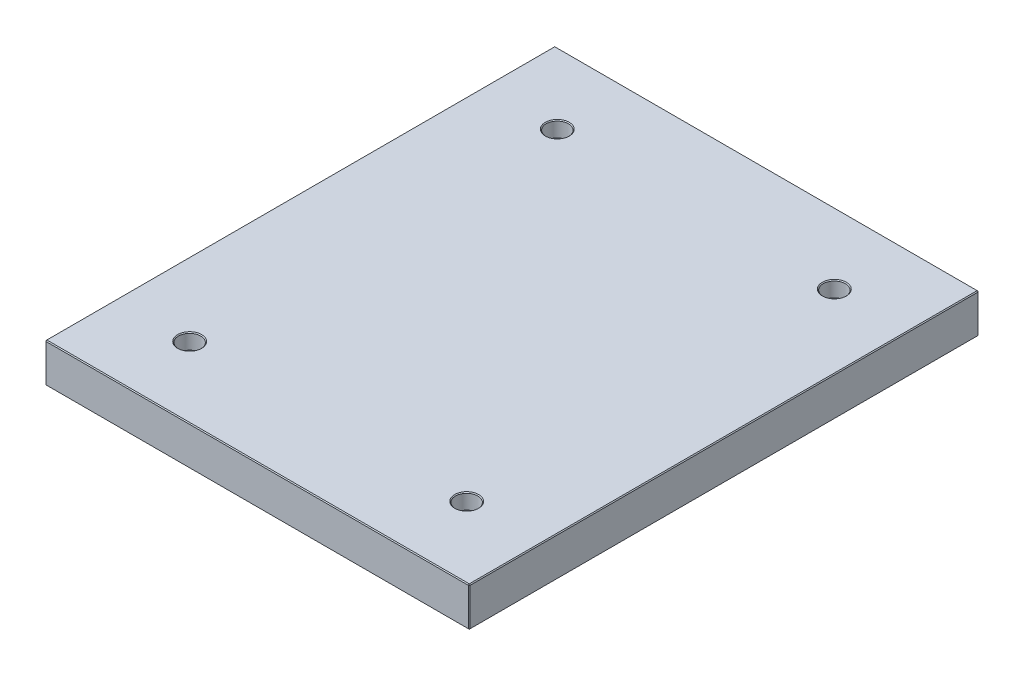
ISO-10303-21;
HEADER;
FILE_DESCRIPTION(('STEP AP214'),'2;1');
FILE_NAME('part.step','',(''),(''),'','','');
FILE_SCHEMA(('AUTOMOTIVE_DESIGN { 1 0 10303 214 1 1 1 1 }'));
ENDSEC;
DATA;
#1=APPLICATION_CONTEXT('core data for automotive mechanical design processes');
#2=APPLICATION_PROTOCOL_DEFINITION('international standard','automotive_design',2000,#1);
#3=PRODUCT_CONTEXT('',#1,'mechanical');
#4=PRODUCT('Part','Part','',(#3));
#5=PRODUCT_RELATED_PRODUCT_CATEGORY('part','',(#4));
#6=PRODUCT_DEFINITION_FORMATION('','',#4);
#7=PRODUCT_DEFINITION_CONTEXT('part definition',#1,'design');
#8=PRODUCT_DEFINITION('design','',#6,#7);
#9=PRODUCT_DEFINITION_SHAPE('','',#8);
#10=(LENGTH_UNIT() NAMED_UNIT(*) SI_UNIT(.MILLI.,.METRE.));
#11=(NAMED_UNIT(*) PLANE_ANGLE_UNIT() SI_UNIT($,.RADIAN.));
#12=(NAMED_UNIT(*) SI_UNIT($,.STERADIAN.) SOLID_ANGLE_UNIT());
#13=UNCERTAINTY_MEASURE_WITH_UNIT(LENGTH_MEASURE(1.E-05),#10,'distance_accuracy_value','');
#14=(GEOMETRIC_REPRESENTATION_CONTEXT(3) GLOBAL_UNCERTAINTY_ASSIGNED_CONTEXT((#13)) GLOBAL_UNIT_ASSIGNED_CONTEXT((#10,
#11,#12)) REPRESENTATION_CONTEXT('',''));
#15=CARTESIAN_POINT('',(0.,0.,0.));
#16=DIRECTION('',(0.,0.,1.));
#17=DIRECTION('',(1.,0.,0.));
#18=AXIS2_PLACEMENT_3D('',#15,#16,#17);
#19=CARTESIAN_POINT('',(-248.,46.,298.));
#20=DIRECTION('',(1.,0.,0.));
#21=DIRECTION('',(0.,0.,-1.));
#22=AXIS2_PLACEMENT_3D('',#19,#20,#21);
#23=PLANE('',#22);
#24=DIRECTION('',(0.,-1.,0.));
#25=VECTOR('',#24,1.);
#26=CARTESIAN_POINT('',(-248.,46.,-297.));
#27=LINE('',#26,#25);
#28=CARTESIAN_POINT('',(-248.,45.,-297.));
#29=VERTEX_POINT('',#28);
#30=CARTESIAN_POINT('',(-248.,1.,-297.));
#31=VERTEX_POINT('',#30);
#32=EDGE_CURVE('E115',#29,#31,#27,.T.);
#33=ORIENTED_EDGE('',*,*,#32,.T.);
#34=DIRECTION('',(0.,0.,1.));
#35=VECTOR('',#34,1.);
#36=CARTESIAN_POINT('',(-248.,1.,298.));
#37=LINE('',#36,#35);
#38=CARTESIAN_POINT('',(-248.,1.,297.));
#39=VERTEX_POINT('',#38);
#40=EDGE_CURVE('E111',#31,#39,#37,.T.);
#41=ORIENTED_EDGE('',*,*,#40,.T.);
#42=DIRECTION('',(0.,1.,0.));
#43=VECTOR('',#42,1.);
#44=CARTESIAN_POINT('',(-248.,46.,297.));
#45=LINE('',#44,#43);
#46=CARTESIAN_POINT('',(-248.,45.,297.));
#47=VERTEX_POINT('',#46);
#48=EDGE_CURVE('E104',#39,#47,#45,.T.);
#49=ORIENTED_EDGE('',*,*,#48,.T.);
#50=DIRECTION('',(0.,0.,-1.));
#51=VECTOR('',#50,1.);
#52=CARTESIAN_POINT('',(-248.,45.,-298.));
#53=LINE('',#52,#51);
#54=EDGE_CURVE('E108',#47,#29,#53,.T.);
#55=ORIENTED_EDGE('',*,*,#54,.T.);
#56=EDGE_LOOP('',(#33,#41,#49,#55));
#57=FACE_BOUND('',#56,.T.);
#58=ADVANCED_FACE('F16',(#57),#23,.F.);
#59=CARTESIAN_POINT('',(248.,46.,298.));
#60=DIRECTION('',(0.,0.,-1.));
#61=DIRECTION('',(-1.,0.,0.));
#62=AXIS2_PLACEMENT_3D('',#59,#60,#61);
#63=PLANE('',#62);
#64=DIRECTION('',(-1.,0.,0.));
#65=VECTOR('',#64,1.);
#66=CARTESIAN_POINT('',(-248.,45.,298.));
#67=LINE('',#66,#65);
#68=CARTESIAN_POINT('',(247.,45.,298.));
#69=VERTEX_POINT('',#68);
#70=CARTESIAN_POINT('',(-247.,45.,298.));
#71=VERTEX_POINT('',#70);
#72=EDGE_CURVE('E170',#69,#71,#67,.T.);
#73=ORIENTED_EDGE('',*,*,#72,.T.);
#74=DIRECTION('',(0.,-1.,0.));
#75=VECTOR('',#74,1.);
#76=CARTESIAN_POINT('',(-247.,46.,298.));
#77=LINE('',#76,#75);
#78=CARTESIAN_POINT('',(-247.,1.,298.));
#79=VERTEX_POINT('',#78);
#80=EDGE_CURVE('E123',#71,#79,#77,.T.);
#81=ORIENTED_EDGE('',*,*,#80,.T.);
#82=DIRECTION('',(1.,0.,0.));
#83=VECTOR('',#82,1.);
#84=CARTESIAN_POINT('',(248.,1.,298.));
#85=LINE('',#84,#83);
#86=CARTESIAN_POINT('',(247.,1.,298.));
#87=VERTEX_POINT('',#86);
#88=EDGE_CURVE('E174',#79,#87,#85,.T.);
#89=ORIENTED_EDGE('',*,*,#88,.T.);
#90=DIRECTION('',(0.,1.,0.));
#91=VECTOR('',#90,1.);
#92=CARTESIAN_POINT('',(247.,46.,298.));
#93=LINE('',#92,#91);
#94=EDGE_CURVE('E172',#87,#69,#93,.T.);
#95=ORIENTED_EDGE('',*,*,#94,.T.);
#96=EDGE_LOOP('',(#73,#81,#89,#95));
#97=FACE_BOUND('',#96,.T.);
#98=ADVANCED_FACE('F317',(#97),#63,.F.);
#99=CARTESIAN_POINT('',(248.,46.,298.));
#100=DIRECTION('',(-1.,0.,0.));
#101=DIRECTION('',(0.,0.,1.));
#102=AXIS2_PLACEMENT_3D('',#99,#100,#101);
#103=PLANE('',#102);
#104=DIRECTION('',(0.,0.,-1.));
#105=VECTOR('',#104,1.);
#106=CARTESIAN_POINT('',(248.,1.,298.));
#107=LINE('',#106,#105);
#108=CARTESIAN_POINT('',(248.,1.,297.));
#109=VERTEX_POINT('',#108);
#110=CARTESIAN_POINT('',(248.,1.,-297.));
#111=VERTEX_POINT('',#110);
#112=EDGE_CURVE('E165',#109,#111,#107,.T.);
#113=ORIENTED_EDGE('',*,*,#112,.T.);
#114=DIRECTION('',(0.,1.,0.));
#115=VECTOR('',#114,1.);
#116=CARTESIAN_POINT('',(248.,46.,-297.));
#117=LINE('',#116,#115);
#118=CARTESIAN_POINT('',(248.,45.,-297.));
#119=VERTEX_POINT('',#118);
#120=EDGE_CURVE('E167',#111,#119,#117,.T.);
#121=ORIENTED_EDGE('',*,*,#120,.T.);
#122=DIRECTION('',(0.,0.,1.));
#123=VECTOR('',#122,1.);
#124=CARTESIAN_POINT('',(248.,45.,298.));
#125=LINE('',#124,#123);
#126=CARTESIAN_POINT('',(248.,45.,297.));
#127=VERTEX_POINT('',#126);
#128=EDGE_CURVE('E161',#119,#127,#125,.T.);
#129=ORIENTED_EDGE('',*,*,#128,.T.);
#130=DIRECTION('',(0.,-1.,0.));
#131=VECTOR('',#130,1.);
#132=CARTESIAN_POINT('',(248.,46.,297.));
#133=LINE('',#132,#131);
#134=EDGE_CURVE('E163',#127,#109,#133,.T.);
#135=ORIENTED_EDGE('',*,*,#134,.T.);
#136=EDGE_LOOP('',(#113,#121,#129,#135));
#137=FACE_BOUND('',#136,.T.);
#138=ADVANCED_FACE('F323',(#137),#103,.F.);
#139=CARTESIAN_POINT('',(248.,46.,-298.));
#140=DIRECTION('',(0.,0.,1.));
#141=DIRECTION('',(1.,0.,0.));
#142=AXIS2_PLACEMENT_3D('',#139,#140,#141);
#143=PLANE('',#142);
#144=DIRECTION('',(0.,-1.,0.));
#145=VECTOR('',#144,1.);
#146=CARTESIAN_POINT('',(247.,46.,-298.));
#147=LINE('',#146,#145);
#148=CARTESIAN_POINT('',(247.,45.,-298.));
#149=VERTEX_POINT('',#148);
#150=CARTESIAN_POINT('',(247.,1.,-298.));
#151=VERTEX_POINT('',#150);
#152=EDGE_CURVE('E154',#149,#151,#147,.T.);
#153=ORIENTED_EDGE('',*,*,#152,.T.);
#154=DIRECTION('',(-1.,0.,0.));
#155=VECTOR('',#154,1.);
#156=CARTESIAN_POINT('',(248.,1.,-298.));
#157=LINE('',#156,#155);
#158=CARTESIAN_POINT('',(-247.,1.,-298.));
#159=VERTEX_POINT('',#158);
#160=EDGE_CURVE('E159',#151,#159,#157,.T.);
#161=ORIENTED_EDGE('',*,*,#160,.T.);
#162=DIRECTION('',(0.,1.,0.));
#163=VECTOR('',#162,1.);
#164=CARTESIAN_POINT('',(-247.,46.,-298.));
#165=LINE('',#164,#163);
#166=CARTESIAN_POINT('',(-247.,45.,-298.));
#167=VERTEX_POINT('',#166);
#168=EDGE_CURVE('E156',#159,#167,#165,.T.);
#169=ORIENTED_EDGE('',*,*,#168,.T.);
#170=DIRECTION('',(1.,0.,0.));
#171=VECTOR('',#170,1.);
#172=CARTESIAN_POINT('',(248.,45.,-298.));
#173=LINE('',#172,#171);
#174=EDGE_CURVE('E152',#167,#149,#173,.T.);
#175=ORIENTED_EDGE('',*,*,#174,.T.);
#176=EDGE_LOOP('',(#153,#161,#169,#175));
#177=FACE_BOUND('',#176,.T.);
#178=ADVANCED_FACE('F465',(#177),#143,.F.);
#179=CARTESIAN_POINT('',(0.,46.,0.));
#180=DIRECTION('',(0.,1.,0.));
#181=DIRECTION('',(0.,0.,1.));
#182=AXIS2_PLACEMENT_3D('',#179,#180,#181);
#183=PLANE('',#182);
#184=CARTESIAN_POINT('',(-162.,46.,215.));
#185=DIRECTION('',(0.,1.,0.));
#186=DIRECTION('',(0.,0.,1.));
#187=AXIS2_PLACEMENT_3D('',#184,#185,#186);
#188=CIRCLE('',#187,14.0000000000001);
#189=CARTESIAN_POINT('',(-162.,46.,229.));
#190=VERTEX_POINT('',#189);
#191=EDGE_CURVE('E290',#190,#190,#188,.F.);
#192=ORIENTED_EDGE('',*,*,#191,.T.);
#193=EDGE_LOOP('',(#192));
#194=FACE_BOUND('',#193,.T.);
#195=CARTESIAN_POINT('',(162.,46.,215.));
#196=DIRECTION('',(0.,1.,0.));
#197=DIRECTION('',(0.,0.,1.));
#198=AXIS2_PLACEMENT_3D('',#195,#196,#197);
#199=CIRCLE('',#198,14.0000000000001);
#200=CARTESIAN_POINT('',(162.,46.,229.));
#201=VERTEX_POINT('',#200);
#202=EDGE_CURVE('E287',#201,#201,#199,.F.);
#203=ORIENTED_EDGE('',*,*,#202,.T.);
#204=EDGE_LOOP('',(#203));
#205=FACE_BOUND('',#204,.T.);
#206=CARTESIAN_POINT('',(162.,46.,-215.));
#207=DIRECTION('',(0.,1.,0.));
#208=DIRECTION('',(0.,0.,1.));
#209=AXIS2_PLACEMENT_3D('',#206,#207,#208);
#210=CIRCLE('',#209,14.0000000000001);
#211=CARTESIAN_POINT('',(162.,46.,-201.));
#212=VERTEX_POINT('',#211);
#213=EDGE_CURVE('E284',#212,#212,#210,.F.);
#214=ORIENTED_EDGE('',*,*,#213,.T.);
#215=EDGE_LOOP('',(#214));
#216=FACE_BOUND('',#215,.T.);
#217=CARTESIAN_POINT('',(-162.,46.,-215.));
#218=DIRECTION('',(0.,1.,0.));
#219=DIRECTION('',(0.,0.,1.));
#220=AXIS2_PLACEMENT_3D('',#217,#218,#219);
#221=CIRCLE('',#220,14.0000000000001);
#222=CARTESIAN_POINT('',(-162.,46.,-201.));
#223=VERTEX_POINT('',#222);
#224=EDGE_CURVE('E281',#223,#223,#221,.F.);
#225=ORIENTED_EDGE('',*,*,#224,.T.);
#226=EDGE_LOOP('',(#225));
#227=FACE_BOUND('',#226,.T.);
#228=DIRECTION('',(0.,0.,-1.));
#229=VECTOR('',#228,1.);
#230=CARTESIAN_POINT('',(247.,46.,-298.));
#231=LINE('',#230,#229);
#232=CARTESIAN_POINT('',(247.,46.,297.));
#233=VERTEX_POINT('',#232);
#234=CARTESIAN_POINT('',(247.,46.,-297.));
#235=VERTEX_POINT('',#234);
#236=EDGE_CURVE('E31',#233,#235,#231,.T.);
#237=ORIENTED_EDGE('',*,*,#236,.T.);
#238=DIRECTION('',(-1.,0.,0.));
#239=VECTOR('',#238,1.);
#240=CARTESIAN_POINT('',(-248.,46.,-297.));
#241=LINE('',#240,#239);
#242=CARTESIAN_POINT('',(-247.,46.,-297.));
#243=VERTEX_POINT('',#242);
#244=EDGE_CURVE('E190',#235,#243,#241,.T.);
#245=ORIENTED_EDGE('',*,*,#244,.T.);
#246=DIRECTION('',(0.,0.,1.));
#247=VECTOR('',#246,1.);
#248=CARTESIAN_POINT('',(-247.,46.,298.));
#249=LINE('',#248,#247);
#250=CARTESIAN_POINT('',(-247.,46.,297.));
#251=VERTEX_POINT('',#250);
#252=EDGE_CURVE('E186',#243,#251,#249,.T.);
#253=ORIENTED_EDGE('',*,*,#252,.T.);
#254=DIRECTION('',(1.,0.,0.));
#255=VECTOR('',#254,1.);
#256=CARTESIAN_POINT('',(248.,46.,297.));
#257=LINE('',#256,#255);
#258=EDGE_CURVE('E36',#251,#233,#257,.T.);
#259=ORIENTED_EDGE('',*,*,#258,.T.);
#260=EDGE_LOOP('',(#237,#245,#253,#259));
#261=FACE_BOUND('',#260,.T.);
#262=ADVANCED_FACE('F462',(#194,#205,#216,#227,#261),#183,.T.);
#263=CARTESIAN_POINT('',(0.,0.,0.));
#264=DIRECTION('',(0.,1.,0.));
#265=DIRECTION('',(0.,0.,1.));
#266=AXIS2_PLACEMENT_3D('',#263,#264,#265);
#267=PLANE('',#266);
#268=CARTESIAN_POINT('',(162.,0.,-215.));
#269=DIRECTION('',(0.,1.,0.));
#270=DIRECTION('',(0.,0.,1.));
#271=AXIS2_PLACEMENT_3D('',#268,#269,#270);
#272=CIRCLE('',#271,10.);
#273=CARTESIAN_POINT('',(162.,0.,-205.));
#274=VERTEX_POINT('',#273);
#275=EDGE_CURVE('E263',#274,#274,#272,.T.);
#276=ORIENTED_EDGE('',*,*,#275,.T.);
#277=EDGE_LOOP('',(#276));
#278=FACE_BOUND('',#277,.T.);
#279=CARTESIAN_POINT('',(162.,0.,215.));
#280=DIRECTION('',(0.,1.,0.));
#281=DIRECTION('',(0.,0.,1.));
#282=AXIS2_PLACEMENT_3D('',#279,#280,#281);
#283=CIRCLE('',#282,10.);
#284=CARTESIAN_POINT('',(162.,0.,225.));
#285=VERTEX_POINT('',#284);
#286=EDGE_CURVE('E260',#285,#285,#283,.T.);
#287=ORIENTED_EDGE('',*,*,#286,.T.);
#288=EDGE_LOOP('',(#287));
#289=FACE_BOUND('',#288,.T.);
#290=CARTESIAN_POINT('',(-162.,0.,215.));
#291=DIRECTION('',(0.,1.,0.));
#292=DIRECTION('',(0.,0.,1.));
#293=AXIS2_PLACEMENT_3D('',#290,#291,#292);
#294=CIRCLE('',#293,10.);
#295=CARTESIAN_POINT('',(-162.,0.,225.));
#296=VERTEX_POINT('',#295);
#297=EDGE_CURVE('E257',#296,#296,#294,.T.);
#298=ORIENTED_EDGE('',*,*,#297,.T.);
#299=EDGE_LOOP('',(#298));
#300=FACE_BOUND('',#299,.T.);
#301=CARTESIAN_POINT('',(-162.,0.,-215.));
#302=DIRECTION('',(0.,1.,0.));
#303=DIRECTION('',(0.,0.,1.));
#304=AXIS2_PLACEMENT_3D('',#301,#302,#303);
#305=CIRCLE('',#304,10.);
#306=CARTESIAN_POINT('',(-162.,0.,-205.));
#307=VERTEX_POINT('',#306);
#308=EDGE_CURVE('E192',#307,#307,#305,.T.);
#309=ORIENTED_EDGE('',*,*,#308,.T.);
#310=EDGE_LOOP('',(#309));
#311=FACE_BOUND('',#310,.T.);
#312=DIRECTION('',(0.,0.,1.));
#313=VECTOR('',#312,1.);
#314=CARTESIAN_POINT('',(247.,0.,0.));
#315=LINE('',#314,#313);
#316=CARTESIAN_POINT('',(247.,0.,-297.));
#317=VERTEX_POINT('',#316);
#318=CARTESIAN_POINT('',(247.,0.,297.));
#319=VERTEX_POINT('',#318);
#320=EDGE_CURVE('E177',#317,#319,#315,.T.);
#321=ORIENTED_EDGE('',*,*,#320,.T.);
#322=DIRECTION('',(-1.,0.,0.));
#323=VECTOR('',#322,1.);
#324=CARTESIAN_POINT('',(0.,0.,297.));
#325=LINE('',#324,#323);
#326=CARTESIAN_POINT('',(-247.,0.,297.));
#327=VERTEX_POINT('',#326);
#328=EDGE_CURVE('E183',#319,#327,#325,.T.);
#329=ORIENTED_EDGE('',*,*,#328,.T.);
#330=DIRECTION('',(0.,0.,-1.));
#331=VECTOR('',#330,1.);
#332=CARTESIAN_POINT('',(-247.,0.,0.));
#333=LINE('',#332,#331);
#334=CARTESIAN_POINT('',(-247.,0.,-297.));
#335=VERTEX_POINT('',#334);
#336=EDGE_CURVE('E181',#327,#335,#333,.T.);
#337=ORIENTED_EDGE('',*,*,#336,.T.);
#338=DIRECTION('',(1.,0.,0.));
#339=VECTOR('',#338,1.);
#340=CARTESIAN_POINT('',(0.,0.,-297.));
#341=LINE('',#340,#339);
#342=EDGE_CURVE('E179',#335,#317,#341,.T.);
#343=ORIENTED_EDGE('',*,*,#342,.T.);
#344=EDGE_LOOP('',(#321,#329,#337,#343));
#345=FACE_BOUND('',#344,.T.);
#346=ADVANCED_FACE('F402',(#278,#289,#300,#311,#345),#267,.F.);
#347=CARTESIAN_POINT('',(248.,46.,297.));
#348=DIRECTION('',(-0.707106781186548,0.,-0.707106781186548));
#349=DIRECTION('',(0.,-1.,0.));
#350=AXIS2_PLACEMENT_3D('',#347,#348,#349);
#351=PLANE('',#350);
#352=DIRECTION('',(-0.707106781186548,0.,0.707106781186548));
#353=VECTOR('',#352,1.);
#354=CARTESIAN_POINT('',(247.,45.,298.));
#355=LINE('',#354,#353);
#356=EDGE_CURVE('E141',#69,#127,#355,.F.);
#357=ORIENTED_EDGE('',*,*,#356,.F.);
#358=ORIENTED_EDGE('',*,*,#94,.F.);
#359=DIRECTION('',(0.707106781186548,0.,-0.707106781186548));
#360=VECTOR('',#359,1.);
#361=CARTESIAN_POINT('',(247.,1.,298.));
#362=LINE('',#361,#360);
#363=EDGE_CURVE('E144',#109,#87,#362,.F.);
#364=ORIENTED_EDGE('',*,*,#363,.F.);
#365=ORIENTED_EDGE('',*,*,#134,.F.);
#366=EDGE_LOOP('',(#357,#358,#364,#365));
#367=FACE_BOUND('',#366,.T.);
#368=ADVANCED_FACE('F398',(#367),#351,.F.);
#369=CARTESIAN_POINT('',(247.,45.,298.));
#370=DIRECTION('',(0.577350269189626,0.577350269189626,0.577350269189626));
#371=DIRECTION('',(0.707106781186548,0.,-0.707106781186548));
#372=AXIS2_PLACEMENT_3D('',#369,#370,#371);
#373=PLANE('',#372);
#374=DIRECTION('',(0.,-0.707106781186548,0.707106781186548));
#375=VECTOR('',#374,1.);
#376=CARTESIAN_POINT('',(247.,45.,298.));
#377=LINE('',#376,#375);
#378=EDGE_CURVE('E235',#69,#233,#377,.F.);
#379=ORIENTED_EDGE('',*,*,#378,.F.);
#380=ORIENTED_EDGE('',*,*,#356,.T.);
#381=DIRECTION('',(-0.707106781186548,0.707106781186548,0.));
#382=VECTOR('',#381,1.);
#383=CARTESIAN_POINT('',(247.5,45.5,297.));
#384=LINE('',#383,#382);
#385=EDGE_CURVE('E237',#233,#127,#384,.F.);
#386=ORIENTED_EDGE('',*,*,#385,.F.);
#387=EDGE_LOOP('',(#379,#380,#386));
#388=FACE_BOUND('',#387,.T.);
#389=ADVANCED_FACE('F394',(#388),#373,.T.);
#390=CARTESIAN_POINT('',(247.,1.,298.));
#391=DIRECTION('',(0.577350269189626,-0.577350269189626,0.577350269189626));
#392=DIRECTION('',(0.707106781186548,0.,-0.707106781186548));
#393=AXIS2_PLACEMENT_3D('',#390,#391,#392);
#394=PLANE('',#393);
#395=DIRECTION('',(-0.707106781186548,-0.707106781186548,0.));
#396=VECTOR('',#395,1.);
#397=CARTESIAN_POINT('',(247.5,0.5,297.));
#398=LINE('',#397,#396);
#399=EDGE_CURVE('E229',#109,#319,#398,.T.);
#400=ORIENTED_EDGE('',*,*,#399,.F.);
#401=ORIENTED_EDGE('',*,*,#363,.T.);
#402=DIRECTION('',(0.,0.707106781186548,0.707106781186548));
#403=VECTOR('',#402,1.);
#404=CARTESIAN_POINT('',(247.,1.,298.));
#405=LINE('',#404,#403);
#406=EDGE_CURVE('E232',#319,#87,#405,.T.);
#407=ORIENTED_EDGE('',*,*,#406,.F.);
#408=EDGE_LOOP('',(#400,#401,#407));
#409=FACE_BOUND('',#408,.T.);
#410=ADVANCED_FACE('F390',(#409),#394,.T.);
#411=CARTESIAN_POINT('',(247.,46.,0.));
#412=DIRECTION('',(0.707106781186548,0.707106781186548,0.));
#413=DIRECTION('',(0.,0.,1.));
#414=AXIS2_PLACEMENT_3D('',#411,#412,#413);
#415=PLANE('',#414);
#416=ORIENTED_EDGE('',*,*,#385,.T.);
#417=ORIENTED_EDGE('',*,*,#128,.F.);
#418=DIRECTION('',(0.707106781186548,-0.707106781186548,0.));
#419=VECTOR('',#418,1.);
#420=CARTESIAN_POINT('',(248.,45.,-297.));
#421=LINE('',#420,#419);
#422=EDGE_CURVE('E224',#235,#119,#421,.T.);
#423=ORIENTED_EDGE('',*,*,#422,.F.);
#424=ORIENTED_EDGE('',*,*,#236,.F.);
#425=EDGE_LOOP('',(#416,#417,#423,#424));
#426=FACE_BOUND('',#425,.T.);
#427=ADVANCED_FACE('F386',(#426),#415,.T.);
#428=CARTESIAN_POINT('',(0.,46.,297.));
#429=DIRECTION('',(0.,0.707106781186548,0.707106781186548));
#430=DIRECTION('',(-1.,0.,0.));
#431=AXIS2_PLACEMENT_3D('',#428,#429,#430);
#432=PLANE('',#431);
#433=ORIENTED_EDGE('',*,*,#378,.T.);
#434=ORIENTED_EDGE('',*,*,#258,.F.);
#435=DIRECTION('',(0.,0.707106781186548,-0.707106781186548));
#436=VECTOR('',#435,1.);
#437=CARTESIAN_POINT('',(-247.,45.5,297.5));
#438=LINE('',#437,#436);
#439=EDGE_CURVE('E127',#71,#251,#438,.T.);
#440=ORIENTED_EDGE('',*,*,#439,.F.);
#441=ORIENTED_EDGE('',*,*,#72,.F.);
#442=EDGE_LOOP('',(#433,#434,#440,#441));
#443=FACE_BOUND('',#442,.T.);
#444=ADVANCED_FACE('F383',(#443),#432,.T.);
#445=CARTESIAN_POINT('',(-247.,46.,298.));
#446=DIRECTION('',(0.707106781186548,0.,-0.707106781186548));
#447=DIRECTION('',(0.,-1.,0.));
#448=AXIS2_PLACEMENT_3D('',#445,#446,#447);
#449=PLANE('',#448);
#450=DIRECTION('',(0.707106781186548,0.,0.707106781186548));
#451=VECTOR('',#450,1.);
#452=CARTESIAN_POINT('',(-247.,1.,298.));
#453=LINE('',#452,#451);
#454=EDGE_CURVE('E128',#79,#39,#453,.F.);
#455=ORIENTED_EDGE('',*,*,#454,.F.);
#456=ORIENTED_EDGE('',*,*,#80,.F.);
#457=DIRECTION('',(-0.707106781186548,0.,-0.707106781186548));
#458=VECTOR('',#457,1.);
#459=CARTESIAN_POINT('',(-248.,45.,297.));
#460=LINE('',#459,#458);
#461=EDGE_CURVE('E119',#47,#71,#460,.F.);
#462=ORIENTED_EDGE('',*,*,#461,.F.);
#463=ORIENTED_EDGE('',*,*,#48,.F.);
#464=EDGE_LOOP('',(#455,#456,#462,#463));
#465=FACE_BOUND('',#464,.T.);
#466=ADVANCED_FACE('F121',(#465),#449,.F.);
#467=CARTESIAN_POINT('',(248.,1.,298.));
#468=DIRECTION('',(0.,0.707106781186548,-0.707106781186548));
#469=DIRECTION('',(1.,0.,0.));
#470=AXIS2_PLACEMENT_3D('',#467,#468,#469);
#471=PLANE('',#470);
#472=ORIENTED_EDGE('',*,*,#406,.T.);
#473=ORIENTED_EDGE('',*,*,#88,.F.);
#474=DIRECTION('',(0.,-0.707106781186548,-0.707106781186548));
#475=VECTOR('',#474,1.);
#476=CARTESIAN_POINT('',(-247.,1.,298.));
#477=LINE('',#476,#475);
#478=EDGE_CURVE('E220',#327,#79,#477,.F.);
#479=ORIENTED_EDGE('',*,*,#478,.F.);
#480=ORIENTED_EDGE('',*,*,#328,.F.);
#481=EDGE_LOOP('',(#472,#473,#479,#480));
#482=FACE_BOUND('',#481,.T.);
#483=ADVANCED_FACE('F376',(#482),#471,.F.);
#484=CARTESIAN_POINT('',(248.,1.,298.));
#485=DIRECTION('',(-0.707106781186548,0.707106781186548,0.));
#486=DIRECTION('',(0.,0.,-1.));
#487=AXIS2_PLACEMENT_3D('',#484,#485,#486);
#488=PLANE('',#487);
#489=ORIENTED_EDGE('',*,*,#399,.T.);
#490=ORIENTED_EDGE('',*,*,#320,.F.);
#491=DIRECTION('',(0.707106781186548,0.707106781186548,0.));
#492=VECTOR('',#491,1.);
#493=CARTESIAN_POINT('',(247.5,0.5,-297.));
#494=LINE('',#493,#492);
#495=EDGE_CURVE('E217',#111,#317,#494,.F.);
#496=ORIENTED_EDGE('',*,*,#495,.F.);
#497=ORIENTED_EDGE('',*,*,#112,.F.);
#498=EDGE_LOOP('',(#489,#490,#496,#497));
#499=FACE_BOUND('',#498,.T.);
#500=ADVANCED_FACE('F372',(#499),#488,.F.);
#501=CARTESIAN_POINT('',(247.,46.,-298.));
#502=DIRECTION('',(-0.707106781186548,0.,0.707106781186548));
#503=DIRECTION('',(0.,-1.,0.));
#504=AXIS2_PLACEMENT_3D('',#501,#502,#503);
#505=PLANE('',#504);
#506=DIRECTION('',(0.707106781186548,0.,0.707106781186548));
#507=VECTOR('',#506,1.);
#508=CARTESIAN_POINT('',(248.,45.,-297.));
#509=LINE('',#508,#507);
#510=EDGE_CURVE('E226',#119,#149,#509,.F.);
#511=ORIENTED_EDGE('',*,*,#510,.F.);
#512=ORIENTED_EDGE('',*,*,#120,.F.);
#513=DIRECTION('',(-0.707106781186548,0.,-0.707106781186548));
#514=VECTOR('',#513,1.);
#515=CARTESIAN_POINT('',(247.,1.,-298.));
#516=LINE('',#515,#514);
#517=EDGE_CURVE('E214',#151,#111,#516,.F.);
#518=ORIENTED_EDGE('',*,*,#517,.F.);
#519=ORIENTED_EDGE('',*,*,#152,.F.);
#520=EDGE_LOOP('',(#511,#512,#518,#519));
#521=FACE_BOUND('',#520,.T.);
#522=ADVANCED_FACE('F368',(#521),#505,.F.);
#523=CARTESIAN_POINT('',(248.,45.,-297.));
#524=DIRECTION('',(0.577350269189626,0.577350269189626,-0.577350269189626));
#525=DIRECTION('',(-0.707106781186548,0.,-0.707106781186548));
#526=AXIS2_PLACEMENT_3D('',#523,#524,#525);
#527=PLANE('',#526);
#528=ORIENTED_EDGE('',*,*,#422,.T.);
#529=ORIENTED_EDGE('',*,*,#510,.T.);
#530=DIRECTION('',(0.,0.707106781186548,0.707106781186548));
#531=VECTOR('',#530,1.);
#532=CARTESIAN_POINT('',(247.,45.5,-297.5));
#533=LINE('',#532,#531);
#534=EDGE_CURVE('E135',#235,#149,#533,.F.);
#535=ORIENTED_EDGE('',*,*,#534,.F.);
#536=EDGE_LOOP('',(#528,#529,#535));
#537=FACE_BOUND('',#536,.T.);
#538=ADVANCED_FACE('F365',(#537),#527,.T.);
#539=CARTESIAN_POINT('',(-248.,45.,297.));
#540=DIRECTION('',(-0.577350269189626,0.577350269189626,0.577350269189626));
#541=DIRECTION('',(0.707106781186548,0.,0.707106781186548));
#542=AXIS2_PLACEMENT_3D('',#539,#540,#541);
#543=PLANE('',#542);
#544=ORIENTED_EDGE('',*,*,#461,.T.);
#545=ORIENTED_EDGE('',*,*,#439,.T.);
#546=DIRECTION('',(-0.707106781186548,-0.707106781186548,0.));
#547=VECTOR('',#546,1.);
#548=CARTESIAN_POINT('',(-248.,45.,297.));
#549=LINE('',#548,#547);
#550=EDGE_CURVE('E131',#47,#251,#549,.F.);
#551=ORIENTED_EDGE('',*,*,#550,.F.);
#552=EDGE_LOOP('',(#544,#545,#551));
#553=FACE_BOUND('',#552,.T.);
#554=ADVANCED_FACE('F132',(#553),#543,.T.);
#555=CARTESIAN_POINT('',(-247.,1.,298.));
#556=DIRECTION('',(-0.577350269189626,-0.577350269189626,0.577350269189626));
#557=DIRECTION('',(0.707106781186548,0.,0.707106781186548));
#558=AXIS2_PLACEMENT_3D('',#555,#556,#557);
#559=PLANE('',#558);
#560=ORIENTED_EDGE('',*,*,#478,.T.);
#561=ORIENTED_EDGE('',*,*,#454,.T.);
#562=DIRECTION('',(-0.707106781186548,0.707106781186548,0.));
#563=VECTOR('',#562,1.);
#564=CARTESIAN_POINT('',(-247.5,0.5,297.));
#565=LINE('',#564,#563);
#566=EDGE_CURVE('E136',#327,#39,#565,.T.);
#567=ORIENTED_EDGE('',*,*,#566,.F.);
#568=EDGE_LOOP('',(#560,#561,#567));
#569=FACE_BOUND('',#568,.T.);
#570=ADVANCED_FACE('F358',(#569),#559,.T.);
#571=CARTESIAN_POINT('',(247.,1.,-298.));
#572=DIRECTION('',(0.577350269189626,-0.577350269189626,-0.577350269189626));
#573=DIRECTION('',(-0.707106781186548,0.,-0.707106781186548));
#574=AXIS2_PLACEMENT_3D('',#571,#572,#573);
#575=PLANE('',#574);
#576=ORIENTED_EDGE('',*,*,#517,.T.);
#577=ORIENTED_EDGE('',*,*,#495,.T.);
#578=DIRECTION('',(0.,-0.707106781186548,0.707106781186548));
#579=VECTOR('',#578,1.);
#580=CARTESIAN_POINT('',(247.,1.,-298.));
#581=LINE('',#580,#579);
#582=EDGE_CURVE('E207',#151,#317,#581,.T.);
#583=ORIENTED_EDGE('',*,*,#582,.F.);
#584=EDGE_LOOP('',(#576,#577,#583));
#585=FACE_BOUND('',#584,.T.);
#586=ADVANCED_FACE('F354',(#585),#575,.T.);
#587=CARTESIAN_POINT('',(0.,46.,-297.));
#588=DIRECTION('',(0.,0.707106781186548,-0.707106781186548));
#589=DIRECTION('',(1.,0.,0.));
#590=AXIS2_PLACEMENT_3D('',#587,#588,#589);
#591=PLANE('',#590);
#592=ORIENTED_EDGE('',*,*,#534,.T.);
#593=ORIENTED_EDGE('',*,*,#174,.F.);
#594=DIRECTION('',(0.,-0.707106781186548,-0.707106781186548));
#595=VECTOR('',#594,1.);
#596=CARTESIAN_POINT('',(-247.,45.,-298.));
#597=LINE('',#596,#595);
#598=EDGE_CURVE('E204',#243,#167,#597,.T.);
#599=ORIENTED_EDGE('',*,*,#598,.F.);
#600=ORIENTED_EDGE('',*,*,#244,.F.);
#601=EDGE_LOOP('',(#592,#593,#599,#600));
#602=FACE_BOUND('',#601,.T.);
#603=ADVANCED_FACE('F351',(#602),#591,.T.);
#604=CARTESIAN_POINT('',(-247.,46.,0.));
#605=DIRECTION('',(-0.707106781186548,0.707106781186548,0.));
#606=DIRECTION('',(0.,0.,-1.));
#607=AXIS2_PLACEMENT_3D('',#604,#605,#606);
#608=PLANE('',#607);
#609=ORIENTED_EDGE('',*,*,#550,.T.);
#610=ORIENTED_EDGE('',*,*,#252,.F.);
#611=DIRECTION('',(0.707106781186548,0.707106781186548,0.));
#612=VECTOR('',#611,1.);
#613=CARTESIAN_POINT('',(-247.5,45.5,-297.));
#614=LINE('',#613,#612);
#615=EDGE_CURVE('E139',#29,#243,#614,.T.);
#616=ORIENTED_EDGE('',*,*,#615,.F.);
#617=ORIENTED_EDGE('',*,*,#54,.F.);
#618=EDGE_LOOP('',(#609,#610,#616,#617));
#619=FACE_BOUND('',#618,.T.);
#620=ADVANCED_FACE('F138',(#619),#608,.T.);
#621=CARTESIAN_POINT('',(-248.,1.,298.));
#622=DIRECTION('',(0.707106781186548,0.707106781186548,0.));
#623=DIRECTION('',(0.,0.,1.));
#624=AXIS2_PLACEMENT_3D('',#621,#622,#623);
#625=PLANE('',#624);
#626=ORIENTED_EDGE('',*,*,#566,.T.);
#627=ORIENTED_EDGE('',*,*,#40,.F.);
#628=DIRECTION('',(0.707106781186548,-0.707106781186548,0.));
#629=VECTOR('',#628,1.);
#630=CARTESIAN_POINT('',(-248.,1.,-297.));
#631=LINE('',#630,#629);
#632=EDGE_CURVE('E200',#335,#31,#631,.F.);
#633=ORIENTED_EDGE('',*,*,#632,.F.);
#634=ORIENTED_EDGE('',*,*,#336,.F.);
#635=EDGE_LOOP('',(#626,#627,#633,#634));
#636=FACE_BOUND('',#635,.T.);
#637=ADVANCED_FACE('F344',(#636),#625,.F.);
#638=CARTESIAN_POINT('',(248.,1.,-298.));
#639=DIRECTION('',(0.,0.707106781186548,0.707106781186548));
#640=DIRECTION('',(-1.,0.,0.));
#641=AXIS2_PLACEMENT_3D('',#638,#639,#640);
#642=PLANE('',#641);
#643=ORIENTED_EDGE('',*,*,#582,.T.);
#644=ORIENTED_EDGE('',*,*,#342,.F.);
#645=DIRECTION('',(0.,0.707106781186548,-0.707106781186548));
#646=VECTOR('',#645,1.);
#647=CARTESIAN_POINT('',(-247.,0.5,-297.5));
#648=LINE('',#647,#646);
#649=EDGE_CURVE('E197',#159,#335,#648,.F.);
#650=ORIENTED_EDGE('',*,*,#649,.F.);
#651=ORIENTED_EDGE('',*,*,#160,.F.);
#652=EDGE_LOOP('',(#643,#644,#650,#651));
#653=FACE_BOUND('',#652,.T.);
#654=ADVANCED_FACE('F340',(#653),#642,.F.);
#655=CARTESIAN_POINT('',(-247.,45.,-298.));
#656=DIRECTION('',(-0.577350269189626,0.577350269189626,-0.577350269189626));
#657=DIRECTION('',(-0.707106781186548,0.,0.707106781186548));
#658=AXIS2_PLACEMENT_3D('',#655,#656,#657);
#659=PLANE('',#658);
#660=ORIENTED_EDGE('',*,*,#615,.T.);
#661=ORIENTED_EDGE('',*,*,#598,.T.);
#662=DIRECTION('',(0.707106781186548,0.,-0.707106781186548));
#663=VECTOR('',#662,1.);
#664=CARTESIAN_POINT('',(-247.,45.,-298.));
#665=LINE('',#664,#663);
#666=EDGE_CURVE('E195',#29,#167,#665,.T.);
#667=ORIENTED_EDGE('',*,*,#666,.F.);
#668=EDGE_LOOP('',(#660,#661,#667));
#669=FACE_BOUND('',#668,.T.);
#670=ADVANCED_FACE('F336',(#669),#659,.T.);
#671=CARTESIAN_POINT('',(-248.,1.,-297.));
#672=DIRECTION('',(-0.577350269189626,-0.577350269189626,-0.577350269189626));
#673=DIRECTION('',(-0.707106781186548,0.,0.707106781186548));
#674=AXIS2_PLACEMENT_3D('',#671,#672,#673);
#675=PLANE('',#674);
#676=ORIENTED_EDGE('',*,*,#649,.T.);
#677=ORIENTED_EDGE('',*,*,#632,.T.);
#678=DIRECTION('',(-0.707106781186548,0.,0.707106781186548));
#679=VECTOR('',#678,1.);
#680=CARTESIAN_POINT('',(-248.,1.,-297.));
#681=LINE('',#680,#679);
#682=EDGE_CURVE('E193',#159,#31,#681,.T.);
#683=ORIENTED_EDGE('',*,*,#682,.F.);
#684=EDGE_LOOP('',(#676,#677,#683));
#685=FACE_BOUND('',#684,.T.);
#686=ADVANCED_FACE('F332',(#685),#675,.T.);
#687=CARTESIAN_POINT('',(-248.,46.,-297.));
#688=DIRECTION('',(0.707106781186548,0.,0.707106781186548));
#689=DIRECTION('',(0.,-1.,0.));
#690=AXIS2_PLACEMENT_3D('',#687,#688,#689);
#691=PLANE('',#690);
#692=ORIENTED_EDGE('',*,*,#666,.T.);
#693=ORIENTED_EDGE('',*,*,#168,.F.);
#694=ORIENTED_EDGE('',*,*,#682,.T.);
#695=ORIENTED_EDGE('',*,*,#32,.F.);
#696=EDGE_LOOP('',(#692,#693,#694,#695));
#697=FACE_BOUND('',#696,.T.);
#698=ADVANCED_FACE('F328',(#697),#691,.F.);
#699=CARTESIAN_POINT('',(-162.,28.,-215.));
#700=DIRECTION('',(0.,1.,0.));
#701=DIRECTION('',(0.,0.,1.));
#702=AXIS2_PLACEMENT_3D('',#699,#700,#701);
#703=CYLINDRICAL_SURFACE('',#702,13.);
#704=CARTESIAN_POINT('',(-162.,45.,-215.));
#705=DIRECTION('',(0.,1.,0.));
#706=DIRECTION('',(0.,0.,1.));
#707=AXIS2_PLACEMENT_3D('',#704,#705,#706);
#708=CIRCLE('',#707,13.);
#709=CARTESIAN_POINT('',(-162.,45.,-202.));
#710=VERTEX_POINT('',#709);
#711=EDGE_CURVE('E10',#710,#710,#708,.T.);
#712=ORIENTED_EDGE('',*,*,#711,.T.);
#713=EDGE_LOOP('',(#712));
#714=FACE_BOUND('',#713,.T.);
#715=CARTESIAN_POINT('',(-162.,28.,-215.));
#716=DIRECTION('',(0.,1.,0.));
#717=DIRECTION('',(0.,0.,1.));
#718=AXIS2_PLACEMENT_3D('',#715,#716,#717);
#719=CIRCLE('',#718,13.);
#720=CARTESIAN_POINT('',(-162.,28.,-202.));
#721=VERTEX_POINT('',#720);
#722=EDGE_CURVE('E147',#721,#721,#719,.T.);
#723=ORIENTED_EDGE('',*,*,#722,.F.);
#724=EDGE_LOOP('',(#723));
#725=FACE_BOUND('',#724,.T.);
#726=ADVANCED_FACE('F331',(#714,#725),#703,.F.);
#727=CARTESIAN_POINT('',(-162.,28.,-215.));
#728=DIRECTION('',(0.,1.,0.));
#729=DIRECTION('',(0.,0.,1.));
#730=AXIS2_PLACEMENT_3D('',#727,#728,#729);
#731=PLANE('',#730);
#732=CARTESIAN_POINT('',(-162.,28.,-215.));
#733=DIRECTION('',(0.,1.,0.));
#734=DIRECTION('',(0.,0.,1.));
#735=AXIS2_PLACEMENT_3D('',#732,#733,#734);
#736=CIRCLE('',#735,9.);
#737=CARTESIAN_POINT('',(-162.,28.,-206.));
#738=VERTEX_POINT('',#737);
#739=EDGE_CURVE('E251',#738,#738,#736,.T.);
#740=ORIENTED_EDGE('',*,*,#739,.F.);
#741=EDGE_LOOP('',(#740));
#742=FACE_BOUND('',#741,.T.);
#743=ORIENTED_EDGE('',*,*,#722,.T.);
#744=EDGE_LOOP('',(#743));
#745=FACE_BOUND('',#744,.T.);
#746=ADVANCED_FACE('F450',(#742,#745),#731,.T.);
#747=CARTESIAN_POINT('',(162.,28.,-215.));
#748=DIRECTION('',(0.,1.,0.));
#749=DIRECTION('',(0.,0.,1.));
#750=AXIS2_PLACEMENT_3D('',#747,#748,#749);
#751=CYLINDRICAL_SURFACE('',#750,13.);
#752=CARTESIAN_POINT('',(162.,45.,-215.));
#753=DIRECTION('',(0.,1.,0.));
#754=DIRECTION('',(0.,0.,1.));
#755=AXIS2_PLACEMENT_3D('',#752,#753,#754);
#756=CIRCLE('',#755,13.);
#757=CARTESIAN_POINT('',(162.,45.,-202.));
#758=VERTEX_POINT('',#757);
#759=EDGE_CURVE('E24',#758,#758,#756,.T.);
#760=ORIENTED_EDGE('',*,*,#759,.T.);
#761=EDGE_LOOP('',(#760));
#762=FACE_BOUND('',#761,.T.);
#763=CARTESIAN_POINT('',(162.,28.,-215.));
#764=DIRECTION('',(0.,1.,0.));
#765=DIRECTION('',(0.,0.,1.));
#766=AXIS2_PLACEMENT_3D('',#763,#764,#765);
#767=CIRCLE('',#766,13.);
#768=CARTESIAN_POINT('',(162.,28.,-202.));
#769=VERTEX_POINT('',#768);
#770=EDGE_CURVE('E441',#769,#769,#767,.T.);
#771=ORIENTED_EDGE('',*,*,#770,.F.);
#772=EDGE_LOOP('',(#771));
#773=FACE_BOUND('',#772,.T.);
#774=ADVANCED_FACE('F298',(#762,#773),#751,.F.);
#775=CARTESIAN_POINT('',(162.,28.,-215.));
#776=DIRECTION('',(0.,1.,0.));
#777=DIRECTION('',(0.,0.,1.));
#778=AXIS2_PLACEMENT_3D('',#775,#776,#777);
#779=PLANE('',#778);
#780=CARTESIAN_POINT('',(162.,28.,-215.));
#781=DIRECTION('',(0.,1.,0.));
#782=DIRECTION('',(0.,0.,1.));
#783=AXIS2_PLACEMENT_3D('',#780,#781,#782);
#784=CIRCLE('',#783,9.);
#785=CARTESIAN_POINT('',(162.,28.,-206.));
#786=VERTEX_POINT('',#785);
#787=EDGE_CURVE('E248',#786,#786,#784,.T.);
#788=ORIENTED_EDGE('',*,*,#787,.F.);
#789=EDGE_LOOP('',(#788));
#790=FACE_BOUND('',#789,.T.);
#791=ORIENTED_EDGE('',*,*,#770,.T.);
#792=EDGE_LOOP('',(#791));
#793=FACE_BOUND('',#792,.T.);
#794=ADVANCED_FACE('F738',(#790,#793),#779,.T.);
#795=CARTESIAN_POINT('',(162.,28.,215.));
#796=DIRECTION('',(0.,1.,0.));
#797=DIRECTION('',(0.,0.,1.));
#798=AXIS2_PLACEMENT_3D('',#795,#796,#797);
#799=CYLINDRICAL_SURFACE('',#798,13.);
#800=CARTESIAN_POINT('',(162.,45.,215.));
#801=DIRECTION('',(0.,1.,0.));
#802=DIRECTION('',(0.,0.,1.));
#803=AXIS2_PLACEMENT_3D('',#800,#801,#802);
#804=CIRCLE('',#803,13.);
#805=CARTESIAN_POINT('',(162.,45.,228.));
#806=VERTEX_POINT('',#805);
#807=EDGE_CURVE('E293',#806,#806,#804,.T.);
#808=ORIENTED_EDGE('',*,*,#807,.T.);
#809=EDGE_LOOP('',(#808));
#810=FACE_BOUND('',#809,.T.);
#811=CARTESIAN_POINT('',(162.,28.,215.));
#812=DIRECTION('',(0.,1.,0.));
#813=DIRECTION('',(0.,0.,1.));
#814=AXIS2_PLACEMENT_3D('',#811,#812,#813);
#815=CIRCLE('',#814,13.);
#816=CARTESIAN_POINT('',(162.,28.,228.));
#817=VERTEX_POINT('',#816);
#818=EDGE_CURVE('E439',#817,#817,#815,.T.);
#819=ORIENTED_EDGE('',*,*,#818,.F.);
#820=EDGE_LOOP('',(#819));
#821=FACE_BOUND('',#820,.T.);
#822=ADVANCED_FACE('F730',(#810,#821),#799,.F.);
#823=CARTESIAN_POINT('',(162.,28.,215.));
#824=DIRECTION('',(0.,1.,0.));
#825=DIRECTION('',(0.,0.,1.));
#826=AXIS2_PLACEMENT_3D('',#823,#824,#825);
#827=PLANE('',#826);
#828=CARTESIAN_POINT('',(162.,28.,215.));
#829=DIRECTION('',(0.,1.,0.));
#830=DIRECTION('',(0.,0.,1.));
#831=AXIS2_PLACEMENT_3D('',#828,#829,#830);
#832=CIRCLE('',#831,9.);
#833=CARTESIAN_POINT('',(162.,28.,224.));
#834=VERTEX_POINT('',#833);
#835=EDGE_CURVE('E245',#834,#834,#832,.T.);
#836=ORIENTED_EDGE('',*,*,#835,.F.);
#837=EDGE_LOOP('',(#836));
#838=FACE_BOUND('',#837,.T.);
#839=ORIENTED_EDGE('',*,*,#818,.T.);
#840=EDGE_LOOP('',(#839));
#841=FACE_BOUND('',#840,.T.);
#842=ADVANCED_FACE('F434',(#838,#841),#827,.T.);
#843=CARTESIAN_POINT('',(-162.,28.,215.));
#844=DIRECTION('',(0.,1.,0.));
#845=DIRECTION('',(0.,0.,1.));
#846=AXIS2_PLACEMENT_3D('',#843,#844,#845);
#847=CYLINDRICAL_SURFACE('',#846,13.);
#848=CARTESIAN_POINT('',(-162.,45.,215.));
#849=DIRECTION('',(0.,1.,0.));
#850=DIRECTION('',(0.,0.,1.));
#851=AXIS2_PLACEMENT_3D('',#848,#849,#850);
#852=CIRCLE('',#851,13.);
#853=CARTESIAN_POINT('',(-162.,45.,228.));
#854=VERTEX_POINT('',#853);
#855=EDGE_CURVE('E278',#854,#854,#852,.T.);
#856=ORIENTED_EDGE('',*,*,#855,.T.);
#857=EDGE_LOOP('',(#856));
#858=FACE_BOUND('',#857,.T.);
#859=CARTESIAN_POINT('',(-162.,28.,215.));
#860=DIRECTION('',(0.,1.,0.));
#861=DIRECTION('',(0.,0.,1.));
#862=AXIS2_PLACEMENT_3D('',#859,#860,#861);
#863=CIRCLE('',#862,13.);
#864=CARTESIAN_POINT('',(-162.,28.,228.));
#865=VERTEX_POINT('',#864);
#866=EDGE_CURVE('E254',#865,#865,#863,.T.);
#867=ORIENTED_EDGE('',*,*,#866,.F.);
#868=EDGE_LOOP('',(#867));
#869=FACE_BOUND('',#868,.T.);
#870=ADVANCED_FACE('F430',(#858,#869),#847,.F.);
#871=CARTESIAN_POINT('',(-162.,28.,215.));
#872=DIRECTION('',(0.,1.,0.));
#873=DIRECTION('',(0.,0.,1.));
#874=AXIS2_PLACEMENT_3D('',#871,#872,#873);
#875=PLANE('',#874);
#876=CARTESIAN_POINT('',(-162.,28.,215.));
#877=DIRECTION('',(0.,1.,0.));
#878=DIRECTION('',(0.,0.,1.));
#879=AXIS2_PLACEMENT_3D('',#876,#877,#878);
#880=CIRCLE('',#879,9.);
#881=CARTESIAN_POINT('',(-162.,28.,224.));
#882=VERTEX_POINT('',#881);
#883=EDGE_CURVE('E242',#882,#882,#880,.T.);
#884=ORIENTED_EDGE('',*,*,#883,.F.);
#885=EDGE_LOOP('',(#884));
#886=FACE_BOUND('',#885,.T.);
#887=ORIENTED_EDGE('',*,*,#866,.T.);
#888=EDGE_LOOP('',(#887));
#889=FACE_BOUND('',#888,.T.);
#890=ADVANCED_FACE('F433',(#886,#889),#875,.T.);
#891=CARTESIAN_POINT('',(-162.,0.,215.));
#892=DIRECTION('',(0.,1.,0.));
#893=DIRECTION('',(0.,0.,1.));
#894=AXIS2_PLACEMENT_3D('',#891,#892,#893);
#895=CYLINDRICAL_SURFACE('',#894,9.);
#896=CARTESIAN_POINT('',(-162.,0.999999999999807,215.));
#897=DIRECTION('',(0.,1.,0.));
#898=DIRECTION('',(0.,0.,1.));
#899=AXIS2_PLACEMENT_3D('',#896,#897,#898);
#900=CIRCLE('',#899,9.);
#901=CARTESIAN_POINT('',(-162.,0.999999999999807,224.));
#902=VERTEX_POINT('',#901);
#903=EDGE_CURVE('E272',#902,#902,#900,.F.);
#904=ORIENTED_EDGE('',*,*,#903,.T.);
#905=EDGE_LOOP('',(#904));
#906=FACE_BOUND('',#905,.T.);
#907=ORIENTED_EDGE('',*,*,#883,.T.);
#908=EDGE_LOOP('',(#907));
#909=FACE_BOUND('',#908,.T.);
#910=ADVANCED_FACE('F705',(#906,#909),#895,.F.);
#911=CARTESIAN_POINT('',(162.,0.,215.));
#912=DIRECTION('',(0.,1.,0.));
#913=DIRECTION('',(0.,0.,1.));
#914=AXIS2_PLACEMENT_3D('',#911,#912,#913);
#915=CYLINDRICAL_SURFACE('',#914,9.);
#916=CARTESIAN_POINT('',(162.,0.999999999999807,215.));
#917=DIRECTION('',(0.,1.,0.));
#918=DIRECTION('',(0.,0.,1.));
#919=AXIS2_PLACEMENT_3D('',#916,#917,#918);
#920=CIRCLE('',#919,9.);
#921=CARTESIAN_POINT('',(162.,0.999999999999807,224.));
#922=VERTEX_POINT('',#921);
#923=EDGE_CURVE('E269',#922,#922,#920,.F.);
#924=ORIENTED_EDGE('',*,*,#923,.T.);
#925=EDGE_LOOP('',(#924));
#926=FACE_BOUND('',#925,.T.);
#927=ORIENTED_EDGE('',*,*,#835,.T.);
#928=EDGE_LOOP('',(#927));
#929=FACE_BOUND('',#928,.T.);
#930=ADVANCED_FACE('F697',(#926,#929),#915,.F.);
#931=CARTESIAN_POINT('',(162.,0.,-215.));
#932=DIRECTION('',(0.,1.,0.));
#933=DIRECTION('',(0.,0.,1.));
#934=AXIS2_PLACEMENT_3D('',#931,#932,#933);
#935=CYLINDRICAL_SURFACE('',#934,9.);
#936=CARTESIAN_POINT('',(162.,0.999999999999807,-215.));
#937=DIRECTION('',(0.,1.,0.));
#938=DIRECTION('',(0.,0.,1.));
#939=AXIS2_PLACEMENT_3D('',#936,#937,#938);
#940=CIRCLE('',#939,9.);
#941=CARTESIAN_POINT('',(162.,0.999999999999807,-206.));
#942=VERTEX_POINT('',#941);
#943=EDGE_CURVE('E266',#942,#942,#940,.F.);
#944=ORIENTED_EDGE('',*,*,#943,.T.);
#945=EDGE_LOOP('',(#944));
#946=FACE_BOUND('',#945,.T.);
#947=ORIENTED_EDGE('',*,*,#787,.T.);
#948=EDGE_LOOP('',(#947));
#949=FACE_BOUND('',#948,.T.);
#950=ADVANCED_FACE('F688',(#946,#949),#935,.F.);
#951=CARTESIAN_POINT('',(-162.,0.,-215.));
#952=DIRECTION('',(0.,1.,0.));
#953=DIRECTION('',(0.,0.,1.));
#954=AXIS2_PLACEMENT_3D('',#951,#952,#953);
#955=CYLINDRICAL_SURFACE('',#954,9.);
#956=CARTESIAN_POINT('',(-162.,0.999999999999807,-215.));
#957=DIRECTION('',(0.,1.,0.));
#958=DIRECTION('',(0.,0.,1.));
#959=AXIS2_PLACEMENT_3D('',#956,#957,#958);
#960=CIRCLE('',#959,9.);
#961=CARTESIAN_POINT('',(-162.,0.999999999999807,-206.));
#962=VERTEX_POINT('',#961);
#963=EDGE_CURVE('E275',#962,#962,#960,.F.);
#964=ORIENTED_EDGE('',*,*,#963,.T.);
#965=EDGE_LOOP('',(#964));
#966=FACE_BOUND('',#965,.T.);
#967=ORIENTED_EDGE('',*,*,#739,.T.);
#968=EDGE_LOOP('',(#967));
#969=FACE_BOUND('',#968,.T.);
#970=ADVANCED_FACE('F408',(#966,#969),#955,.F.);
#971=CARTESIAN_POINT('',(162.,0.,-215.));
#972=DIRECTION('',(0.,-1.,0.));
#973=DIRECTION('',(0.,0.,-1.));
#974=AXIS2_PLACEMENT_3D('',#971,#972,#973);
#975=CONICAL_SURFACE('',#974,10.,0.785398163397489);
#976=ORIENTED_EDGE('',*,*,#943,.F.);
#977=EDGE_LOOP('',(#976));
#978=FACE_BOUND('',#977,.T.);
#979=ORIENTED_EDGE('',*,*,#275,.F.);
#980=EDGE_LOOP('',(#979));
#981=FACE_BOUND('',#980,.T.);
#982=ADVANCED_FACE('F404',(#978,#981),#975,.F.);
#983=CARTESIAN_POINT('',(162.,0.,215.));
#984=DIRECTION('',(0.,-1.,0.));
#985=DIRECTION('',(0.,0.,-1.));
#986=AXIS2_PLACEMENT_3D('',#983,#984,#985);
#987=CONICAL_SURFACE('',#986,10.,0.785398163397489);
#988=ORIENTED_EDGE('',*,*,#923,.F.);
#989=EDGE_LOOP('',(#988));
#990=FACE_BOUND('',#989,.T.);
#991=ORIENTED_EDGE('',*,*,#286,.F.);
#992=EDGE_LOOP('',(#991));
#993=FACE_BOUND('',#992,.T.);
#994=ADVANCED_FACE('F407',(#990,#993),#987,.F.);
#995=CARTESIAN_POINT('',(-162.,0.,215.));
#996=DIRECTION('',(0.,-1.,0.));
#997=DIRECTION('',(0.,0.,-1.));
#998=AXIS2_PLACEMENT_3D('',#995,#996,#997);
#999=CONICAL_SURFACE('',#998,10.,0.785398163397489);
#1000=ORIENTED_EDGE('',*,*,#903,.F.);
#1001=EDGE_LOOP('',(#1000));
#1002=FACE_BOUND('',#1001,.T.);
#1003=ORIENTED_EDGE('',*,*,#297,.F.);
#1004=EDGE_LOOP('',(#1003));
#1005=FACE_BOUND('',#1004,.T.);
#1006=ADVANCED_FACE('F412',(#1002,#1005),#999,.F.);
#1007=CARTESIAN_POINT('',(-162.,0.,-215.));
#1008=DIRECTION('',(0.,-1.,0.));
#1009=DIRECTION('',(0.,0.,-1.));
#1010=AXIS2_PLACEMENT_3D('',#1007,#1008,#1009);
#1011=CONICAL_SURFACE('',#1010,10.,0.785398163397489);
#1012=ORIENTED_EDGE('',*,*,#963,.F.);
#1013=EDGE_LOOP('',(#1012));
#1014=FACE_BOUND('',#1013,.T.);
#1015=ORIENTED_EDGE('',*,*,#308,.F.);
#1016=EDGE_LOOP('',(#1015));
#1017=FACE_BOUND('',#1016,.T.);
#1018=ADVANCED_FACE('F416',(#1014,#1017),#1011,.F.);
#1019=CARTESIAN_POINT('',(-162.,45.,215.));
#1020=DIRECTION('',(0.,1.,0.));
#1021=DIRECTION('',(0.,0.,1.));
#1022=AXIS2_PLACEMENT_3D('',#1019,#1020,#1021);
#1023=CONICAL_SURFACE('',#1022,13.,0.785398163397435);
#1024=ORIENTED_EDGE('',*,*,#191,.F.);
#1025=EDGE_LOOP('',(#1024));
#1026=FACE_BOUND('',#1025,.T.);
#1027=ORIENTED_EDGE('',*,*,#855,.F.);
#1028=EDGE_LOOP('',(#1027));
#1029=FACE_BOUND('',#1028,.T.);
#1030=ADVANCED_FACE('F312',(#1026,#1029),#1023,.F.);
#1031=CARTESIAN_POINT('',(162.,45.,215.));
#1032=DIRECTION('',(0.,1.,0.));
#1033=DIRECTION('',(0.,0.,1.));
#1034=AXIS2_PLACEMENT_3D('',#1031,#1032,#1033);
#1035=CONICAL_SURFACE('',#1034,13.,0.785398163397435);
#1036=ORIENTED_EDGE('',*,*,#202,.F.);
#1037=EDGE_LOOP('',(#1036));
#1038=FACE_BOUND('',#1037,.T.);
#1039=ORIENTED_EDGE('',*,*,#807,.F.);
#1040=EDGE_LOOP('',(#1039));
#1041=FACE_BOUND('',#1040,.T.);
#1042=ADVANCED_FACE('F303',(#1038,#1041),#1035,.F.);
#1043=CARTESIAN_POINT('',(162.,45.,-215.));
#1044=DIRECTION('',(0.,1.,0.));
#1045=DIRECTION('',(0.,0.,1.));
#1046=AXIS2_PLACEMENT_3D('',#1043,#1044,#1045);
#1047=CONICAL_SURFACE('',#1046,13.,0.785398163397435);
#1048=ORIENTED_EDGE('',*,*,#213,.F.);
#1049=EDGE_LOOP('',(#1048));
#1050=FACE_BOUND('',#1049,.T.);
#1051=ORIENTED_EDGE('',*,*,#759,.F.);
#1052=EDGE_LOOP('',(#1051));
#1053=FACE_BOUND('',#1052,.T.);
#1054=ADVANCED_FACE('F301',(#1050,#1053),#1047,.F.);
#1055=CARTESIAN_POINT('',(-162.,45.,-215.));
#1056=DIRECTION('',(0.,1.,0.));
#1057=DIRECTION('',(0.,0.,1.));
#1058=AXIS2_PLACEMENT_3D('',#1055,#1056,#1057);
#1059=CONICAL_SURFACE('',#1058,13.,0.785398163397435);
#1060=ORIENTED_EDGE('',*,*,#224,.F.);
#1061=EDGE_LOOP('',(#1060));
#1062=FACE_BOUND('',#1061,.T.);
#1063=ORIENTED_EDGE('',*,*,#711,.F.);
#1064=EDGE_LOOP('',(#1063));
#1065=FACE_BOUND('',#1064,.T.);
#1066=ADVANCED_FACE('F18',(#1062,#1065),#1059,.F.);
#1067=CLOSED_SHELL('',(#58,#98,#138,#178,#262,#346,#368,#389,#410,#427,#444,#466,#483,#500,#522,
#538,#554,#570,#586,#603,#620,#637,#654,#670,#686,#698,#726,#746,#774,#794,#822,#842,#870,#890,
#910,#930,#950,#970,#982,#994,#1006,#1018,#1030,#1042,#1054,#1066));
#1068=MANIFOLD_SOLID_BREP('B1',#1067);
#1069=ADVANCED_BREP_SHAPE_REPRESENTATION('',(#18,#1068),#14);
#1070=SHAPE_DEFINITION_REPRESENTATION(#9,#1069);
ENDSEC;
END-ISO-10303-21;
